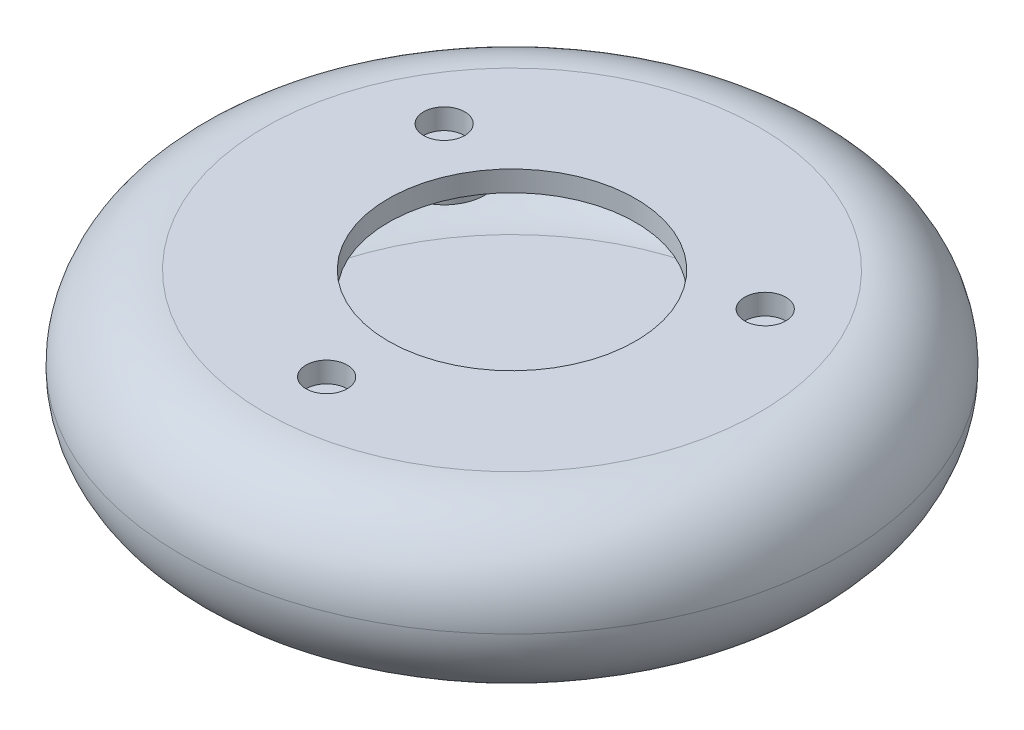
ISO-10303-21;
HEADER;
FILE_DESCRIPTION(('STEP AP214'),'2;1');
FILE_NAME('part.step','',(''),(''),'','','');
FILE_SCHEMA(('AUTOMOTIVE_DESIGN { 1 0 10303 214 1 1 1 1 }'));
ENDSEC;
DATA;
#1=APPLICATION_CONTEXT('core data for automotive mechanical design processes');
#2=APPLICATION_PROTOCOL_DEFINITION('international standard','automotive_design',2000,#1);
#3=PRODUCT_CONTEXT('',#1,'mechanical');
#4=PRODUCT('Part','Part','',(#3));
#5=PRODUCT_RELATED_PRODUCT_CATEGORY('part','',(#4));
#6=PRODUCT_DEFINITION_FORMATION('','',#4);
#7=PRODUCT_DEFINITION_CONTEXT('part definition',#1,'design');
#8=PRODUCT_DEFINITION('design','',#6,#7);
#9=PRODUCT_DEFINITION_SHAPE('','',#8);
#10=(LENGTH_UNIT() NAMED_UNIT(*) SI_UNIT(.MILLI.,.METRE.));
#11=(NAMED_UNIT(*) PLANE_ANGLE_UNIT() SI_UNIT($,.RADIAN.));
#12=(NAMED_UNIT(*) SI_UNIT($,.STERADIAN.) SOLID_ANGLE_UNIT());
#13=UNCERTAINTY_MEASURE_WITH_UNIT(LENGTH_MEASURE(1.E-05),#10,'distance_accuracy_value','');
#14=(GEOMETRIC_REPRESENTATION_CONTEXT(3) GLOBAL_UNCERTAINTY_ASSIGNED_CONTEXT((#13)) GLOBAL_UNIT_ASSIGNED_CONTEXT((#10,
#11,#12)) REPRESENTATION_CONTEXT('',''));
#15=CARTESIAN_POINT('',(0.,0.,0.));
#16=DIRECTION('',(0.,0.,1.));
#17=DIRECTION('',(1.,0.,0.));
#18=AXIS2_PLACEMENT_3D('',#15,#16,#17);
#19=CARTESIAN_POINT('',(0.,40.,0.));
#20=DIRECTION('',(0.,1.,0.));
#21=DIRECTION('',(0.,0.,1.));
#22=AXIS2_PLACEMENT_3D('',#19,#20,#21);
#23=PLANE('',#22);
#24=CARTESIAN_POINT('',(38.9711431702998,40.,-22.5));
#25=DIRECTION('',(0.,1.,0.));
#26=DIRECTION('',(0.,0.,1.));
#27=AXIS2_PLACEMENT_3D('',#24,#25,#26);
#28=CIRCLE('',#27,5.);
#29=CARTESIAN_POINT('',(38.9711431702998,40.,-17.5));
#30=VERTEX_POINT('',#29);
#31=EDGE_CURVE('E51',#30,#30,#28,.T.);
#32=ORIENTED_EDGE('',*,*,#31,.F.);
#33=EDGE_LOOP('',(#32));
#34=FACE_BOUND('',#33,.T.);
#35=CARTESIAN_POINT('',(-38.9711431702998,40.,-22.5));
#36=DIRECTION('',(0.,1.,0.));
#37=DIRECTION('',(0.,0.,1.));
#38=AXIS2_PLACEMENT_3D('',#35,#36,#37);
#39=CIRCLE('',#38,5.);
#40=CARTESIAN_POINT('',(-38.9711431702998,40.,-17.5));
#41=VERTEX_POINT('',#40);
#42=EDGE_CURVE('E58',#41,#41,#39,.T.);
#43=ORIENTED_EDGE('',*,*,#42,.F.);
#44=EDGE_LOOP('',(#43));
#45=FACE_BOUND('',#44,.T.);
#46=CARTESIAN_POINT('',(0.,40.,45.));
#47=DIRECTION('',(0.,1.,0.));
#48=DIRECTION('',(0.,0.,1.));
#49=AXIS2_PLACEMENT_3D('',#46,#47,#48);
#50=CIRCLE('',#49,5.);
#51=CARTESIAN_POINT('',(0.,40.,50.));
#52=VERTEX_POINT('',#51);
#53=EDGE_CURVE('E64',#52,#52,#50,.T.);
#54=ORIENTED_EDGE('',*,*,#53,.F.);
#55=EDGE_LOOP('',(#54));
#56=FACE_BOUND('',#55,.T.);
#57=CARTESIAN_POINT('',(0.,40.,0.));
#58=DIRECTION('',(0.,1.,0.));
#59=DIRECTION('',(0.,0.,1.));
#60=AXIS2_PLACEMENT_3D('',#57,#58,#59);
#61=CIRCLE('',#60,30.);
#62=CARTESIAN_POINT('',(0.,40.,30.));
#63=VERTEX_POINT('',#62);
#64=EDGE_CURVE('E44',#63,#63,#61,.T.);
#65=ORIENTED_EDGE('',*,*,#64,.F.);
#66=EDGE_LOOP('',(#65));
#67=FACE_BOUND('',#66,.T.);
#68=CARTESIAN_POINT('',(0.,40.,0.));
#69=DIRECTION('',(0.,1.,0.));
#70=DIRECTION('',(0.,0.,1.));
#71=AXIS2_PLACEMENT_3D('',#68,#69,#70);
#72=CIRCLE('',#71,60.);
#73=CARTESIAN_POINT('',(0.,40.,60.));
#74=VERTEX_POINT('',#73);
#75=EDGE_CURVE('E10',#74,#74,#72,.T.);
#76=ORIENTED_EDGE('',*,*,#75,.T.);
#77=EDGE_LOOP('',(#76));
#78=FACE_BOUND('',#77,.T.);
#79=ADVANCED_FACE('F30',(#34,#45,#56,#67,#78),#23,.T.);
#80=CARTESIAN_POINT('',(0.,0.,0.));
#81=DIRECTION('',(0.,1.,0.));
#82=DIRECTION('',(0.,0.,1.));
#83=AXIS2_PLACEMENT_3D('',#80,#81,#82);
#84=PLANE('',#83);
#85=CARTESIAN_POINT('',(0.,0.,0.));
#86=DIRECTION('',(0.,-1.,0.));
#87=DIRECTION('',(0.,0.,-1.));
#88=AXIS2_PLACEMENT_3D('',#85,#86,#87);
#89=CIRCLE('',#88,5.);
#90=CARTESIAN_POINT('',(0.,0.,-5.));
#91=VERTEX_POINT('',#90);
#92=EDGE_CURVE('E96',#91,#91,#89,.T.);
#93=ORIENTED_EDGE('',*,*,#92,.F.);
#94=EDGE_LOOP('',(#93));
#95=FACE_BOUND('',#94,.T.);
#96=CARTESIAN_POINT('',(0.,0.,0.));
#97=DIRECTION('',(0.,1.,0.));
#98=DIRECTION('',(0.,0.,1.));
#99=AXIS2_PLACEMENT_3D('',#96,#97,#98);
#100=CIRCLE('',#99,60.);
#101=CARTESIAN_POINT('',(0.,0.,60.));
#102=VERTEX_POINT('',#101);
#103=EDGE_CURVE('E38',#102,#102,#100,.F.);
#104=ORIENTED_EDGE('',*,*,#103,.T.);
#105=EDGE_LOOP('',(#104));
#106=FACE_BOUND('',#105,.T.);
#107=ADVANCED_FACE('F112',(#95,#106),#84,.F.);
#108=CARTESIAN_POINT('',(0.,20.,0.));
#109=DIRECTION('',(0.,1.,0.));
#110=DIRECTION('',(0.,0.,1.));
#111=AXIS2_PLACEMENT_3D('',#108,#109,#110);
#112=TOROIDAL_SURFACE('',#111,60.,20.);
#113=ORIENTED_EDGE('',*,*,#75,.F.);
#114=EDGE_LOOP('',(#113));
#115=FACE_BOUND('',#114,.T.);
#116=CARTESIAN_POINT('',(0.,20.,0.));
#117=DIRECTION('',(0.,1.,0.));
#118=DIRECTION('',(0.,0.,1.));
#119=AXIS2_PLACEMENT_3D('',#116,#117,#118);
#120=CIRCLE('',#119,80.);
#121=CARTESIAN_POINT('',(0.,20.,80.));
#122=VERTEX_POINT('',#121);
#123=EDGE_CURVE('E34',#122,#122,#120,.F.);
#124=ORIENTED_EDGE('',*,*,#123,.F.);
#125=EDGE_LOOP('',(#124));
#126=FACE_BOUND('',#125,.T.);
#127=ADVANCED_FACE('F32',(#115,#126),#112,.T.);
#128=CARTESIAN_POINT('',(0.,20.,0.));
#129=DIRECTION('',(0.,1.,0.));
#130=DIRECTION('',(0.,0.,1.));
#131=AXIS2_PLACEMENT_3D('',#128,#129,#130);
#132=TOROIDAL_SURFACE('',#131,60.,20.);
#133=ORIENTED_EDGE('',*,*,#103,.F.);
#134=EDGE_LOOP('',(#133));
#135=FACE_BOUND('',#134,.T.);
#136=ORIENTED_EDGE('',*,*,#123,.T.);
#137=EDGE_LOOP('',(#136));
#138=FACE_BOUND('',#137,.T.);
#139=ADVANCED_FACE('F118',(#135,#138),#132,.T.);
#140=CARTESIAN_POINT('',(0.,35.,0.));
#141=DIRECTION('',(0.,1.,0.));
#142=DIRECTION('',(0.,0.,1.));
#143=AXIS2_PLACEMENT_3D('',#140,#141,#142);
#144=CYLINDRICAL_SURFACE('',#143,30.);
#145=CARTESIAN_POINT('',(0.,35.,0.));
#146=DIRECTION('',(0.,1.,0.));
#147=DIRECTION('',(0.,0.,1.));
#148=AXIS2_PLACEMENT_3D('',#145,#146,#147);
#149=CIRCLE('',#148,30.);
#150=CARTESIAN_POINT('',(0.,35.,30.));
#151=VERTEX_POINT('',#150);
#152=EDGE_CURVE('E48',#151,#151,#149,.T.);
#153=ORIENTED_EDGE('',*,*,#152,.F.);
#154=EDGE_LOOP('',(#153));
#155=FACE_BOUND('',#154,.T.);
#156=ORIENTED_EDGE('',*,*,#64,.T.);
#157=EDGE_LOOP('',(#156));
#158=FACE_BOUND('',#157,.T.);
#159=ADVANCED_FACE('F121',(#155,#158),#144,.F.);
#160=CARTESIAN_POINT('',(0.,35.,45.));
#161=DIRECTION('',(0.,1.,0.));
#162=DIRECTION('',(0.,0.,1.));
#163=AXIS2_PLACEMENT_3D('',#160,#161,#162);
#164=CYLINDRICAL_SURFACE('',#163,5.);
#165=CARTESIAN_POINT('',(0.,35.,45.));
#166=DIRECTION('',(0.,1.,0.));
#167=DIRECTION('',(0.,0.,1.));
#168=AXIS2_PLACEMENT_3D('',#165,#166,#167);
#169=CIRCLE('',#168,5.);
#170=CARTESIAN_POINT('',(0.,35.,50.));
#171=VERTEX_POINT('',#170);
#172=EDGE_CURVE('E47',#171,#171,#169,.T.);
#173=ORIENTED_EDGE('',*,*,#172,.F.);
#174=EDGE_LOOP('',(#173));
#175=FACE_BOUND('',#174,.T.);
#176=ORIENTED_EDGE('',*,*,#53,.T.);
#177=EDGE_LOOP('',(#176));
#178=FACE_BOUND('',#177,.T.);
#179=ADVANCED_FACE('F139',(#175,#178),#164,.F.);
#180=CARTESIAN_POINT('',(0.,35.,45.));
#181=DIRECTION('',(0.,1.,0.));
#182=DIRECTION('',(0.,0.,1.));
#183=AXIS2_PLACEMENT_3D('',#180,#181,#182);
#184=PLANE('',#183);
#185=ORIENTED_EDGE('',*,*,#172,.T.);
#186=EDGE_LOOP('',(#185));
#187=FACE_BOUND('',#186,.T.);
#188=ADVANCED_FACE('F154',(#187),#184,.T.);
#189=CARTESIAN_POINT('',(-38.9711431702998,35.,-22.5));
#190=DIRECTION('',(0.,1.,0.));
#191=DIRECTION('',(0.,0.,1.));
#192=AXIS2_PLACEMENT_3D('',#189,#190,#191);
#193=CYLINDRICAL_SURFACE('',#192,5.);
#194=CARTESIAN_POINT('',(-38.9711431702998,35.,-22.5));
#195=DIRECTION('',(0.,1.,0.));
#196=DIRECTION('',(0.,0.,1.));
#197=AXIS2_PLACEMENT_3D('',#194,#195,#196);
#198=CIRCLE('',#197,5.);
#199=CARTESIAN_POINT('',(-38.9711431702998,35.,-17.5));
#200=VERTEX_POINT('',#199);
#201=EDGE_CURVE('E61',#200,#200,#198,.T.);
#202=ORIENTED_EDGE('',*,*,#201,.F.);
#203=EDGE_LOOP('',(#202));
#204=FACE_BOUND('',#203,.T.);
#205=ORIENTED_EDGE('',*,*,#42,.T.);
#206=EDGE_LOOP('',(#205));
#207=FACE_BOUND('',#206,.T.);
#208=ADVANCED_FACE('F151',(#204,#207),#193,.F.);
#209=CARTESIAN_POINT('',(-38.9711431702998,35.,-22.5));
#210=DIRECTION('',(0.,1.,0.));
#211=DIRECTION('',(0.,0.,1.));
#212=AXIS2_PLACEMENT_3D('',#209,#210,#211);
#213=PLANE('',#212);
#214=ORIENTED_EDGE('',*,*,#201,.T.);
#215=EDGE_LOOP('',(#214));
#216=FACE_BOUND('',#215,.T.);
#217=ADVANCED_FACE('F145',(#216),#213,.T.);
#218=CARTESIAN_POINT('',(38.9711431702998,35.,-22.5));
#219=DIRECTION('',(0.,1.,0.));
#220=DIRECTION('',(0.,0.,1.));
#221=AXIS2_PLACEMENT_3D('',#218,#219,#220);
#222=CYLINDRICAL_SURFACE('',#221,5.);
#223=CARTESIAN_POINT('',(38.9711431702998,35.,-22.5));
#224=DIRECTION('',(0.,1.,0.));
#225=DIRECTION('',(0.,0.,1.));
#226=AXIS2_PLACEMENT_3D('',#223,#224,#225);
#227=CIRCLE('',#226,5.);
#228=CARTESIAN_POINT('',(38.9711431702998,35.,-17.5));
#229=VERTEX_POINT('',#228);
#230=EDGE_CURVE('E55',#229,#229,#227,.T.);
#231=ORIENTED_EDGE('',*,*,#230,.F.);
#232=EDGE_LOOP('',(#231));
#233=FACE_BOUND('',#232,.T.);
#234=ORIENTED_EDGE('',*,*,#31,.T.);
#235=EDGE_LOOP('',(#234));
#236=FACE_BOUND('',#235,.T.);
#237=ADVANCED_FACE('F141',(#233,#236),#222,.F.);
#238=CARTESIAN_POINT('',(38.9711431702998,35.,-22.5));
#239=DIRECTION('',(0.,1.,0.));
#240=DIRECTION('',(0.,0.,1.));
#241=AXIS2_PLACEMENT_3D('',#238,#239,#240);
#242=PLANE('',#241);
#243=ORIENTED_EDGE('',*,*,#230,.T.);
#244=EDGE_LOOP('',(#243));
#245=FACE_BOUND('',#244,.T.);
#246=ADVANCED_FACE('F144',(#245),#242,.T.);
#247=CARTESIAN_POINT('',(0.,35.,0.));
#248=DIRECTION('',(0.,1.,0.));
#249=DIRECTION('',(0.,0.,1.));
#250=AXIS2_PLACEMENT_3D('',#247,#248,#249);
#251=PLANE('',#250);
#252=ORIENTED_EDGE('',*,*,#152,.T.);
#253=EDGE_LOOP('',(#252));
#254=FACE_BOUND('',#253,.T.);
#255=CARTESIAN_POINT('',(38.9711431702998,35.,-22.5));
#256=DIRECTION('',(0.,1.,0.));
#257=DIRECTION('',(0.,0.,1.));
#258=AXIS2_PLACEMENT_3D('',#255,#256,#257);
#259=CIRCLE('',#258,10.);
#260=CARTESIAN_POINT('',(38.9711431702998,35.,-12.5));
#261=VERTEX_POINT('',#260);
#262=EDGE_CURVE('E73',#261,#261,#259,.T.);
#263=ORIENTED_EDGE('',*,*,#262,.T.);
#264=EDGE_LOOP('',(#263));
#265=FACE_BOUND('',#264,.T.);
#266=CARTESIAN_POINT('',(-38.9711431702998,35.,-22.5));
#267=DIRECTION('',(0.,1.,0.));
#268=DIRECTION('',(0.,0.,1.));
#269=AXIS2_PLACEMENT_3D('',#266,#267,#268);
#270=CIRCLE('',#269,10.);
#271=CARTESIAN_POINT('',(-38.9711431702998,35.,-12.5));
#272=VERTEX_POINT('',#271);
#273=EDGE_CURVE('E72',#272,#272,#270,.T.);
#274=ORIENTED_EDGE('',*,*,#273,.T.);
#275=EDGE_LOOP('',(#274));
#276=FACE_BOUND('',#275,.T.);
#277=CARTESIAN_POINT('',(0.,35.,45.));
#278=DIRECTION('',(0.,1.,0.));
#279=DIRECTION('',(0.,0.,1.));
#280=AXIS2_PLACEMENT_3D('',#277,#278,#279);
#281=CIRCLE('',#280,10.);
#282=CARTESIAN_POINT('',(0.,35.,55.));
#283=VERTEX_POINT('',#282);
#284=EDGE_CURVE('E77',#283,#283,#281,.T.);
#285=ORIENTED_EDGE('',*,*,#284,.T.);
#286=EDGE_LOOP('',(#285));
#287=FACE_BOUND('',#286,.T.);
#288=CARTESIAN_POINT('',(0.,35.,0.));
#289=DIRECTION('',(0.,1.,0.));
#290=DIRECTION('',(0.,0.,1.));
#291=AXIS2_PLACEMENT_3D('',#288,#289,#290);
#292=CIRCLE('',#291,60.);
#293=CARTESIAN_POINT('',(0.,35.,60.));
#294=VERTEX_POINT('',#293);
#295=EDGE_CURVE('E52',#294,#294,#292,.T.);
#296=ORIENTED_EDGE('',*,*,#295,.F.);
#297=EDGE_LOOP('',(#296));
#298=FACE_BOUND('',#297,.T.);
#299=ADVANCED_FACE('F149',(#254,#265,#276,#287,#298),#251,.F.);
#300=CARTESIAN_POINT('',(0.,5.,0.));
#301=DIRECTION('',(0.,1.,0.));
#302=DIRECTION('',(0.,0.,1.));
#303=AXIS2_PLACEMENT_3D('',#300,#301,#302);
#304=PLANE('',#303);
#305=CARTESIAN_POINT('',(0.,5.,0.));
#306=DIRECTION('',(0.,-1.,0.));
#307=DIRECTION('',(0.,0.,-1.));
#308=AXIS2_PLACEMENT_3D('',#305,#306,#307);
#309=CIRCLE('',#308,5.);
#310=CARTESIAN_POINT('',(0.,5.,-5.));
#311=VERTEX_POINT('',#310);
#312=EDGE_CURVE('E95',#311,#311,#309,.T.);
#313=ORIENTED_EDGE('',*,*,#312,.T.);
#314=EDGE_LOOP('',(#313));
#315=FACE_BOUND('',#314,.T.);
#316=CARTESIAN_POINT('',(0.,5.,0.));
#317=DIRECTION('',(0.,1.,0.));
#318=DIRECTION('',(0.,0.,1.));
#319=AXIS2_PLACEMENT_3D('',#316,#317,#318);
#320=CIRCLE('',#319,60.);
#321=CARTESIAN_POINT('',(0.,5.,60.));
#322=VERTEX_POINT('',#321);
#323=EDGE_CURVE('E82',#322,#322,#320,.F.);
#324=ORIENTED_EDGE('',*,*,#323,.F.);
#325=EDGE_LOOP('',(#324));
#326=FACE_BOUND('',#325,.T.);
#327=ADVANCED_FACE('F102',(#315,#326),#304,.T.);
#328=CARTESIAN_POINT('',(0.,20.,0.));
#329=DIRECTION('',(0.,1.,0.));
#330=DIRECTION('',(0.,0.,1.));
#331=AXIS2_PLACEMENT_3D('',#328,#329,#330);
#332=TOROIDAL_SURFACE('',#331,60.,15.);
#333=ORIENTED_EDGE('',*,*,#295,.T.);
#334=EDGE_LOOP('',(#333));
#335=FACE_BOUND('',#334,.T.);
#336=CARTESIAN_POINT('',(0.,20.,0.));
#337=DIRECTION('',(0.,1.,0.));
#338=DIRECTION('',(0.,0.,1.));
#339=AXIS2_PLACEMENT_3D('',#336,#337,#338);
#340=CIRCLE('',#339,75.);
#341=CARTESIAN_POINT('',(0.,20.,75.));
#342=VERTEX_POINT('',#341);
#343=EDGE_CURVE('E81',#342,#342,#340,.F.);
#344=ORIENTED_EDGE('',*,*,#343,.T.);
#345=EDGE_LOOP('',(#344));
#346=FACE_BOUND('',#345,.T.);
#347=ADVANCED_FACE('F191',(#335,#346),#332,.F.);
#348=CARTESIAN_POINT('',(0.,20.,0.));
#349=DIRECTION('',(0.,1.,0.));
#350=DIRECTION('',(0.,0.,1.));
#351=AXIS2_PLACEMENT_3D('',#348,#349,#350);
#352=TOROIDAL_SURFACE('',#351,60.,15.);
#353=ORIENTED_EDGE('',*,*,#323,.T.);
#354=EDGE_LOOP('',(#353));
#355=FACE_BOUND('',#354,.T.);
#356=ORIENTED_EDGE('',*,*,#343,.F.);
#357=EDGE_LOOP('',(#356));
#358=FACE_BOUND('',#357,.T.);
#359=ADVANCED_FACE('F187',(#355,#358),#352,.F.);
#360=CARTESIAN_POINT('',(0.,35.,45.));
#361=DIRECTION('',(0.,1.,0.));
#362=DIRECTION('',(0.,0.,1.));
#363=AXIS2_PLACEMENT_3D('',#360,#361,#362);
#364=CYLINDRICAL_SURFACE('',#363,10.);
#365=CARTESIAN_POINT('',(0.,30.,45.));
#366=DIRECTION('',(0.,1.,0.));
#367=DIRECTION('',(0.,0.,1.));
#368=AXIS2_PLACEMENT_3D('',#365,#366,#367);
#369=CIRCLE('',#368,10.);
#370=CARTESIAN_POINT('',(0.,30.,55.));
#371=VERTEX_POINT('',#370);
#372=EDGE_CURVE('E78',#371,#371,#369,.T.);
#373=ORIENTED_EDGE('',*,*,#372,.T.);
#374=EDGE_LOOP('',(#373));
#375=FACE_BOUND('',#374,.T.);
#376=ORIENTED_EDGE('',*,*,#284,.F.);
#377=EDGE_LOOP('',(#376));
#378=FACE_BOUND('',#377,.T.);
#379=ADVANCED_FACE('F183',(#375,#378),#364,.T.);
#380=CARTESIAN_POINT('',(0.,30.,45.));
#381=DIRECTION('',(0.,1.,0.));
#382=DIRECTION('',(0.,0.,1.));
#383=AXIS2_PLACEMENT_3D('',#380,#381,#382);
#384=PLANE('',#383);
#385=ORIENTED_EDGE('',*,*,#372,.F.);
#386=EDGE_LOOP('',(#385));
#387=FACE_BOUND('',#386,.T.);
#388=ADVANCED_FACE('F179',(#387),#384,.F.);
#389=CARTESIAN_POINT('',(-38.9711431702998,35.,-22.5));
#390=DIRECTION('',(0.,1.,0.));
#391=DIRECTION('',(0.,0.,1.));
#392=AXIS2_PLACEMENT_3D('',#389,#390,#391);
#393=CYLINDRICAL_SURFACE('',#392,10.);
#394=CARTESIAN_POINT('',(-38.9711431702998,30.,-22.5));
#395=DIRECTION('',(0.,1.,0.));
#396=DIRECTION('',(0.,0.,1.));
#397=AXIS2_PLACEMENT_3D('',#394,#395,#396);
#398=CIRCLE('',#397,10.);
#399=CARTESIAN_POINT('',(-38.9711431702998,30.,-12.5));
#400=VERTEX_POINT('',#399);
#401=EDGE_CURVE('E74',#400,#400,#398,.T.);
#402=ORIENTED_EDGE('',*,*,#401,.T.);
#403=EDGE_LOOP('',(#402));
#404=FACE_BOUND('',#403,.T.);
#405=ORIENTED_EDGE('',*,*,#273,.F.);
#406=EDGE_LOOP('',(#405));
#407=FACE_BOUND('',#406,.T.);
#408=ADVANCED_FACE('F175',(#404,#407),#393,.T.);
#409=CARTESIAN_POINT('',(-38.9711431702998,30.,-22.5));
#410=DIRECTION('',(0.,1.,0.));
#411=DIRECTION('',(0.,0.,1.));
#412=AXIS2_PLACEMENT_3D('',#409,#410,#411);
#413=PLANE('',#412);
#414=ORIENTED_EDGE('',*,*,#401,.F.);
#415=EDGE_LOOP('',(#414));
#416=FACE_BOUND('',#415,.T.);
#417=ADVANCED_FACE('F171',(#416),#413,.F.);
#418=CARTESIAN_POINT('',(38.9711431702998,35.,-22.5));
#419=DIRECTION('',(0.,1.,0.));
#420=DIRECTION('',(0.,0.,1.));
#421=AXIS2_PLACEMENT_3D('',#418,#419,#420);
#422=CYLINDRICAL_SURFACE('',#421,10.);
#423=CARTESIAN_POINT('',(38.9711431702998,30.,-22.5));
#424=DIRECTION('',(0.,1.,0.));
#425=DIRECTION('',(0.,0.,1.));
#426=AXIS2_PLACEMENT_3D('',#423,#424,#425);
#427=CIRCLE('',#426,10.);
#428=CARTESIAN_POINT('',(38.9711431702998,30.,-12.5));
#429=VERTEX_POINT('',#428);
#430=EDGE_CURVE('E69',#429,#429,#427,.T.);
#431=ORIENTED_EDGE('',*,*,#430,.T.);
#432=EDGE_LOOP('',(#431));
#433=FACE_BOUND('',#432,.T.);
#434=ORIENTED_EDGE('',*,*,#262,.F.);
#435=EDGE_LOOP('',(#434));
#436=FACE_BOUND('',#435,.T.);
#437=ADVANCED_FACE('F167',(#433,#436),#422,.T.);
#438=CARTESIAN_POINT('',(38.9711431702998,30.,-22.5));
#439=DIRECTION('',(0.,1.,0.));
#440=DIRECTION('',(0.,0.,1.));
#441=AXIS2_PLACEMENT_3D('',#438,#439,#440);
#442=PLANE('',#441);
#443=ORIENTED_EDGE('',*,*,#430,.F.);
#444=EDGE_LOOP('',(#443));
#445=FACE_BOUND('',#444,.T.);
#446=ADVANCED_FACE('F108',(#445),#442,.F.);
#447=CARTESIAN_POINT('',(0.,5.,0.));
#448=DIRECTION('',(0.,-1.,0.));
#449=DIRECTION('',(0.,0.,-1.));
#450=AXIS2_PLACEMENT_3D('',#447,#448,#449);
#451=CYLINDRICAL_SURFACE('',#450,5.);
#452=ORIENTED_EDGE('',*,*,#312,.F.);
#453=EDGE_LOOP('',(#452));
#454=FACE_BOUND('',#453,.T.);
#455=ORIENTED_EDGE('',*,*,#92,.T.);
#456=EDGE_LOOP('',(#455));
#457=FACE_BOUND('',#456,.T.);
#458=ADVANCED_FACE('F105',(#454,#457),#451,.F.);
#459=CLOSED_SHELL('',(#79,#107,#127,#139,#159,#179,#188,#208,#217,#237,#246,#299,#327,#347,#359,
#379,#388,#408,#417,#437,#446,#458));
#460=MANIFOLD_SOLID_BREP('B2',#459);
#461=ADVANCED_BREP_SHAPE_REPRESENTATION('',(#18,#460),#14);
#462=SHAPE_DEFINITION_REPRESENTATION(#9,#461);
ENDSEC;
END-ISO-10303-21;
